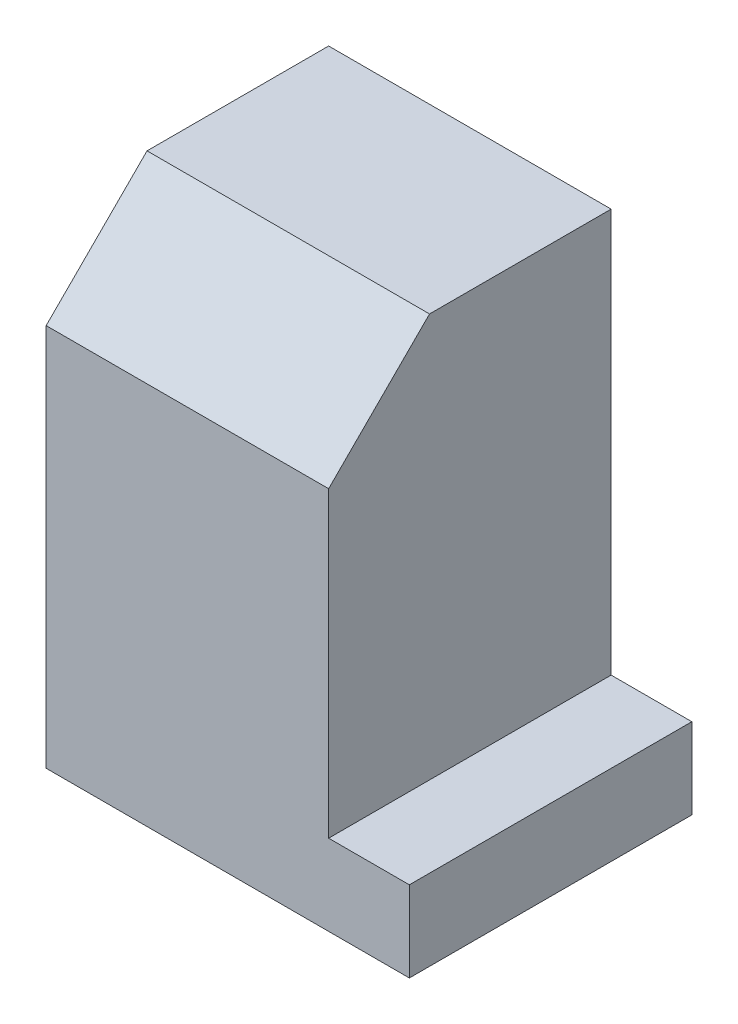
ISO-10303-21;
HEADER;
FILE_DESCRIPTION(('STEP AP214'),'2;1');
FILE_NAME('part.step','',(''),(''),'','','');
FILE_SCHEMA(('AUTOMOTIVE_DESIGN { 1 0 10303 214 1 1 1 1 }'));
ENDSEC;
DATA;
#1=APPLICATION_CONTEXT('core data for automotive mechanical design processes');
#2=APPLICATION_PROTOCOL_DEFINITION('international standard','automotive_design',2000,#1);
#3=PRODUCT_CONTEXT('',#1,'mechanical');
#4=PRODUCT('Part','Part','',(#3));
#5=PRODUCT_RELATED_PRODUCT_CATEGORY('part','',(#4));
#6=PRODUCT_DEFINITION_FORMATION('','',#4);
#7=PRODUCT_DEFINITION_CONTEXT('part definition',#1,'design');
#8=PRODUCT_DEFINITION('design','',#6,#7);
#9=PRODUCT_DEFINITION_SHAPE('','',#8);
#10=(LENGTH_UNIT() NAMED_UNIT(*) SI_UNIT(.MILLI.,.METRE.));
#11=(NAMED_UNIT(*) PLANE_ANGLE_UNIT() SI_UNIT($,.RADIAN.));
#12=(NAMED_UNIT(*) SI_UNIT($,.STERADIAN.) SOLID_ANGLE_UNIT());
#13=UNCERTAINTY_MEASURE_WITH_UNIT(LENGTH_MEASURE(1.E-05),#10,'distance_accuracy_value','');
#14=(GEOMETRIC_REPRESENTATION_CONTEXT(3) GLOBAL_UNCERTAINTY_ASSIGNED_CONTEXT((#13)) GLOBAL_UNIT_ASSIGNED_CONTEXT((#10,
#11,#12)) REPRESENTATION_CONTEXT('',''));
#15=CARTESIAN_POINT('',(0.,0.,0.));
#16=DIRECTION('',(0.,0.,1.));
#17=DIRECTION('',(1.,0.,0.));
#18=AXIS2_PLACEMENT_3D('',#15,#16,#17);
#19=CARTESIAN_POINT('',(0.,120.,70.));
#20=DIRECTION('',(1.,0.,0.));
#21=DIRECTION('',(0.,0.,-1.));
#22=AXIS2_PLACEMENT_3D('',#19,#20,#21);
#23=PLANE('',#22);
#24=DIRECTION('',(0.,-1.,0.));
#25=VECTOR('',#24,1.);
#26=CARTESIAN_POINT('',(0.,120.,70.));
#27=LINE('',#26,#25);
#28=CARTESIAN_POINT('',(0.,95.,70.));
#29=VERTEX_POINT('',#28);
#30=CARTESIAN_POINT('',(0.,0.,70.));
#31=VERTEX_POINT('',#30);
#32=EDGE_CURVE('E86',#29,#31,#27,.T.);
#33=ORIENTED_EDGE('',*,*,#32,.F.);
#34=DIRECTION('',(0.,0.707106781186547,-0.707106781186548));
#35=VECTOR('',#34,1.);
#36=CARTESIAN_POINT('',(0.,120.,45.));
#37=LINE('',#36,#35);
#38=CARTESIAN_POINT('',(0.,120.,45.));
#39=VERTEX_POINT('',#38);
#40=EDGE_CURVE('E44',#29,#39,#37,.T.);
#41=ORIENTED_EDGE('',*,*,#40,.T.);
#42=DIRECTION('',(0.,0.,-1.));
#43=VECTOR('',#42,1.);
#44=CARTESIAN_POINT('',(0.,120.,70.));
#45=LINE('',#44,#43);
#46=CARTESIAN_POINT('',(0.,120.,0.));
#47=VERTEX_POINT('',#46);
#48=EDGE_CURVE('E80',#39,#47,#45,.T.);
#49=ORIENTED_EDGE('',*,*,#48,.T.);
#50=DIRECTION('',(0.,-1.,0.));
#51=VECTOR('',#50,1.);
#52=CARTESIAN_POINT('',(0.,120.,0.));
#53=LINE('',#52,#51);
#54=CARTESIAN_POINT('',(0.,0.,0.));
#55=VERTEX_POINT('',#54);
#56=EDGE_CURVE('E101',#47,#55,#53,.T.);
#57=ORIENTED_EDGE('',*,*,#56,.T.);
#58=DIRECTION('',(0.,0.,-1.));
#59=VECTOR('',#58,1.);
#60=CARTESIAN_POINT('',(0.,0.,70.));
#61=LINE('',#60,#59);
#62=EDGE_CURVE('E11',#31,#55,#61,.T.);
#63=ORIENTED_EDGE('',*,*,#62,.F.);
#64=EDGE_LOOP('',(#33,#41,#49,#57,#63));
#65=FACE_BOUND('',#64,.T.);
#66=ADVANCED_FACE('F30',(#65),#23,.F.);
#67=CARTESIAN_POINT('',(0.,0.,70.));
#68=DIRECTION('',(0.,1.,0.));
#69=DIRECTION('',(0.,0.,1.));
#70=AXIS2_PLACEMENT_3D('',#67,#68,#69);
#71=PLANE('',#70);
#72=DIRECTION('',(1.,0.,0.));
#73=VECTOR('',#72,1.);
#74=CARTESIAN_POINT('',(0.,0.,0.));
#75=LINE('',#74,#73);
#76=CARTESIAN_POINT('',(90.,0.,0.));
#77=VERTEX_POINT('',#76);
#78=EDGE_CURVE('E136',#55,#77,#75,.T.);
#79=ORIENTED_EDGE('',*,*,#78,.T.);
#80=DIRECTION('',(0.,0.,-1.));
#81=VECTOR('',#80,1.);
#82=CARTESIAN_POINT('',(90.,0.,70.));
#83=LINE('',#82,#81);
#84=CARTESIAN_POINT('',(90.,0.,70.));
#85=VERTEX_POINT('',#84);
#86=EDGE_CURVE('E37',#85,#77,#83,.T.);
#87=ORIENTED_EDGE('',*,*,#86,.F.);
#88=DIRECTION('',(1.,0.,0.));
#89=VECTOR('',#88,1.);
#90=CARTESIAN_POINT('',(0.,0.,70.));
#91=LINE('',#90,#89);
#92=EDGE_CURVE('E146',#31,#85,#91,.T.);
#93=ORIENTED_EDGE('',*,*,#92,.F.);
#94=ORIENTED_EDGE('',*,*,#62,.T.);
#95=EDGE_LOOP('',(#79,#87,#93,#94));
#96=FACE_BOUND('',#95,.T.);
#97=ADVANCED_FACE('F152',(#96),#71,.F.);
#98=CARTESIAN_POINT('',(90.,0.,70.));
#99=DIRECTION('',(-1.,0.,0.));
#100=DIRECTION('',(0.,0.,1.));
#101=AXIS2_PLACEMENT_3D('',#98,#99,#100);
#102=PLANE('',#101);
#103=DIRECTION('',(0.,1.,0.));
#104=VECTOR('',#103,1.);
#105=CARTESIAN_POINT('',(90.,0.,0.));
#106=LINE('',#105,#104);
#107=CARTESIAN_POINT('',(90.,20.,0.));
#108=VERTEX_POINT('',#107);
#109=EDGE_CURVE('E130',#77,#108,#106,.T.);
#110=ORIENTED_EDGE('',*,*,#109,.T.);
#111=DIRECTION('',(0.,0.,-1.));
#112=VECTOR('',#111,1.);
#113=CARTESIAN_POINT('',(90.,20.,70.));
#114=LINE('',#113,#112);
#115=CARTESIAN_POINT('',(90.,20.,70.));
#116=VERTEX_POINT('',#115);
#117=EDGE_CURVE('E121',#116,#108,#114,.T.);
#118=ORIENTED_EDGE('',*,*,#117,.F.);
#119=DIRECTION('',(0.,1.,0.));
#120=VECTOR('',#119,1.);
#121=CARTESIAN_POINT('',(90.,0.,70.));
#122=LINE('',#121,#120);
#123=EDGE_CURVE('E131',#85,#116,#122,.T.);
#124=ORIENTED_EDGE('',*,*,#123,.F.);
#125=ORIENTED_EDGE('',*,*,#86,.T.);
#126=EDGE_LOOP('',(#110,#118,#124,#125));
#127=FACE_BOUND('',#126,.T.);
#128=ADVANCED_FACE('F128',(#127),#102,.F.);
#129=CARTESIAN_POINT('',(90.,20.,70.));
#130=DIRECTION('',(0.,-1.,0.));
#131=DIRECTION('',(1.,0.,0.));
#132=AXIS2_PLACEMENT_3D('',#129,#130,#131);
#133=PLANE('',#132);
#134=DIRECTION('',(-1.,0.,0.));
#135=VECTOR('',#134,1.);
#136=CARTESIAN_POINT('',(90.,20.,0.));
#137=LINE('',#136,#135);
#138=CARTESIAN_POINT('',(70.,20.,0.));
#139=VERTEX_POINT('',#138);
#140=EDGE_CURVE('E138',#108,#139,#137,.T.);
#141=ORIENTED_EDGE('',*,*,#140,.T.);
#142=DIRECTION('',(0.,0.,-1.));
#143=VECTOR('',#142,1.);
#144=CARTESIAN_POINT('',(70.,20.,70.));
#145=LINE('',#144,#143);
#146=CARTESIAN_POINT('',(70.,20.,70.));
#147=VERTEX_POINT('',#146);
#148=EDGE_CURVE('E113',#147,#139,#145,.T.);
#149=ORIENTED_EDGE('',*,*,#148,.F.);
#150=DIRECTION('',(-1.,0.,0.));
#151=VECTOR('',#150,1.);
#152=CARTESIAN_POINT('',(90.,20.,70.));
#153=LINE('',#152,#151);
#154=EDGE_CURVE('E53',#116,#147,#153,.T.);
#155=ORIENTED_EDGE('',*,*,#154,.F.);
#156=ORIENTED_EDGE('',*,*,#117,.T.);
#157=EDGE_LOOP('',(#141,#149,#155,#156));
#158=FACE_BOUND('',#157,.T.);
#159=ADVANCED_FACE('F155',(#158),#133,.F.);
#160=CARTESIAN_POINT('',(70.,20.,70.));
#161=DIRECTION('',(-1.,0.,0.));
#162=DIRECTION('',(0.,0.,1.));
#163=AXIS2_PLACEMENT_3D('',#160,#161,#162);
#164=PLANE('',#163);
#165=DIRECTION('',(0.,0.,-1.));
#166=VECTOR('',#165,1.);
#167=CARTESIAN_POINT('',(70.,120.,70.));
#168=LINE('',#167,#166);
#169=CARTESIAN_POINT('',(70.,120.,45.));
#170=VERTEX_POINT('',#169);
#171=CARTESIAN_POINT('',(70.,120.,0.));
#172=VERTEX_POINT('',#171);
#173=EDGE_CURVE('E110',#170,#172,#168,.T.);
#174=ORIENTED_EDGE('',*,*,#173,.F.);
#175=DIRECTION('',(0.,0.707106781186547,-0.707106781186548));
#176=VECTOR('',#175,1.);
#177=CARTESIAN_POINT('',(70.,120.,45.));
#178=LINE('',#177,#176);
#179=CARTESIAN_POINT('',(70.,95.,70.));
#180=VERTEX_POINT('',#179);
#181=EDGE_CURVE('E98',#180,#170,#178,.T.);
#182=ORIENTED_EDGE('',*,*,#181,.F.);
#183=DIRECTION('',(0.,1.,0.));
#184=VECTOR('',#183,1.);
#185=CARTESIAN_POINT('',(70.,20.,70.));
#186=LINE('',#185,#184);
#187=EDGE_CURVE('E111',#147,#180,#186,.T.);
#188=ORIENTED_EDGE('',*,*,#187,.F.);
#189=ORIENTED_EDGE('',*,*,#148,.T.);
#190=DIRECTION('',(0.,1.,0.));
#191=VECTOR('',#190,1.);
#192=CARTESIAN_POINT('',(70.,20.,0.));
#193=LINE('',#192,#191);
#194=EDGE_CURVE('E140',#139,#172,#193,.T.);
#195=ORIENTED_EDGE('',*,*,#194,.T.);
#196=EDGE_LOOP('',(#174,#182,#188,#189,#195));
#197=FACE_BOUND('',#196,.T.);
#198=ADVANCED_FACE('F157',(#197),#164,.F.);
#199=CARTESIAN_POINT('',(70.,120.,70.));
#200=DIRECTION('',(0.,-1.,0.));
#201=DIRECTION('',(1.,0.,0.));
#202=AXIS2_PLACEMENT_3D('',#199,#200,#201);
#203=PLANE('',#202);
#204=ORIENTED_EDGE('',*,*,#48,.F.);
#205=DIRECTION('',(1.,0.,0.));
#206=VECTOR('',#205,1.);
#207=CARTESIAN_POINT('',(0.,120.,45.));
#208=LINE('',#207,#206);
#209=EDGE_CURVE('E95',#39,#170,#208,.T.);
#210=ORIENTED_EDGE('',*,*,#209,.T.);
#211=ORIENTED_EDGE('',*,*,#173,.T.);
#212=DIRECTION('',(-1.,0.,0.));
#213=VECTOR('',#212,1.);
#214=CARTESIAN_POINT('',(70.,120.,0.));
#215=LINE('',#214,#213);
#216=EDGE_CURVE('E108',#172,#47,#215,.T.);
#217=ORIENTED_EDGE('',*,*,#216,.T.);
#218=EDGE_LOOP('',(#204,#210,#211,#217));
#219=FACE_BOUND('',#218,.T.);
#220=ADVANCED_FACE('F106',(#219),#203,.F.);
#221=CARTESIAN_POINT('',(0.,0.,70.));
#222=DIRECTION('',(0.,0.,1.));
#223=DIRECTION('',(1.,0.,0.));
#224=AXIS2_PLACEMENT_3D('',#221,#222,#223);
#225=PLANE('',#224);
#226=DIRECTION('',(1.,0.,0.));
#227=VECTOR('',#226,1.);
#228=CARTESIAN_POINT('',(0.,95.,70.));
#229=LINE('',#228,#227);
#230=EDGE_CURVE('E102',#29,#180,#229,.T.);
#231=ORIENTED_EDGE('',*,*,#230,.F.);
#232=ORIENTED_EDGE('',*,*,#32,.T.);
#233=ORIENTED_EDGE('',*,*,#92,.T.);
#234=ORIENTED_EDGE('',*,*,#123,.T.);
#235=ORIENTED_EDGE('',*,*,#154,.T.);
#236=ORIENTED_EDGE('',*,*,#187,.T.);
#237=EDGE_LOOP('',(#231,#232,#233,#234,#235,#236));
#238=FACE_BOUND('',#237,.T.);
#239=ADVANCED_FACE('F153',(#238),#225,.T.);
#240=CARTESIAN_POINT('',(0.,0.,0.));
#241=DIRECTION('',(0.,0.,1.));
#242=DIRECTION('',(1.,0.,0.));
#243=AXIS2_PLACEMENT_3D('',#240,#241,#242);
#244=PLANE('',#243);
#245=ORIENTED_EDGE('',*,*,#56,.F.);
#246=ORIENTED_EDGE('',*,*,#216,.F.);
#247=ORIENTED_EDGE('',*,*,#194,.F.);
#248=ORIENTED_EDGE('',*,*,#140,.F.);
#249=ORIENTED_EDGE('',*,*,#109,.F.);
#250=ORIENTED_EDGE('',*,*,#78,.F.);
#251=EDGE_LOOP('',(#245,#246,#247,#248,#249,#250));
#252=FACE_BOUND('',#251,.T.);
#253=ADVANCED_FACE('F135',(#252),#244,.F.);
#254=CARTESIAN_POINT('',(0.,120.,45.));
#255=DIRECTION('',(0.,-0.707106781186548,-0.707106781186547));
#256=DIRECTION('',(0.,0.707106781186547,-0.707106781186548));
#257=AXIS2_PLACEMENT_3D('',#254,#255,#256);
#258=PLANE('',#257);
#259=ORIENTED_EDGE('',*,*,#181,.T.);
#260=ORIENTED_EDGE('',*,*,#209,.F.);
#261=ORIENTED_EDGE('',*,*,#40,.F.);
#262=ORIENTED_EDGE('',*,*,#230,.T.);
#263=EDGE_LOOP('',(#259,#260,#261,#262));
#264=FACE_BOUND('',#263,.T.);
#265=ADVANCED_FACE('F96',(#264),#258,.F.);
#266=CLOSED_SHELL('',(#66,#97,#128,#159,#198,#220,#239,#253,#265));
#267=MANIFOLD_SOLID_BREP('B2',#266);
#268=ADVANCED_BREP_SHAPE_REPRESENTATION('',(#18,#267),#14);
#269=SHAPE_DEFINITION_REPRESENTATION(#9,#268);
ENDSEC;
END-ISO-10303-21;
